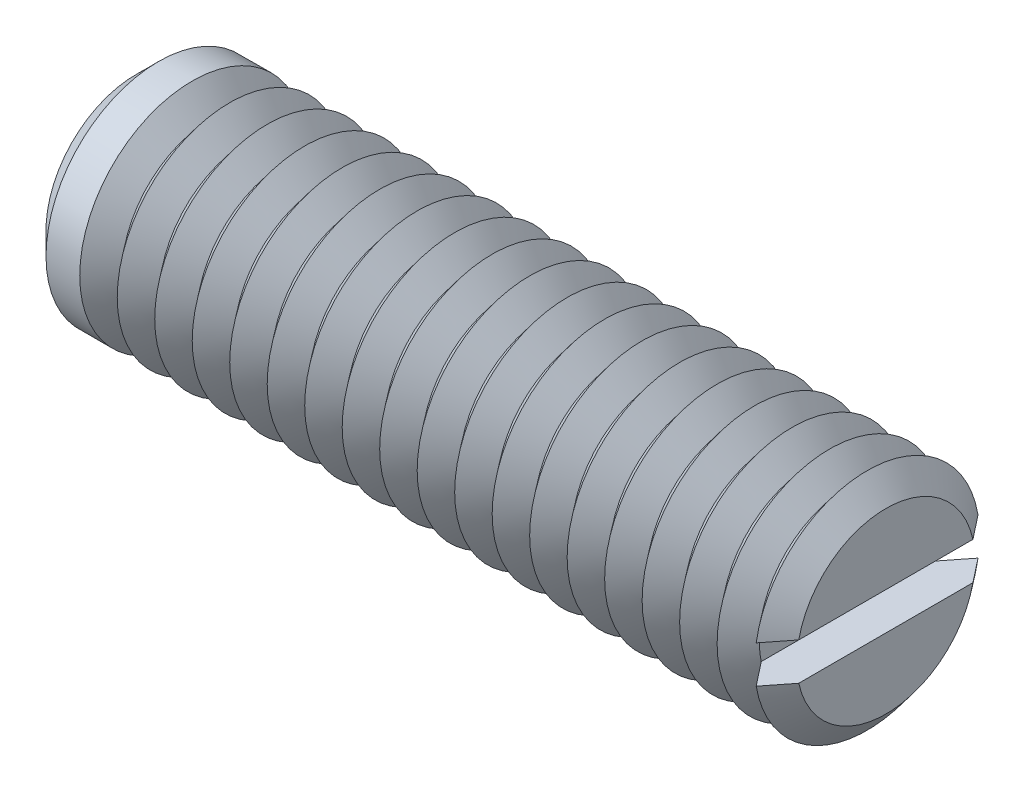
from build123d import *

# Parameters (mm, degrees)
SKETCH1_R       = 3
EXTRUDE1_DEPTH  = 10
SKETCH2_W       = 1
SKETCH2_H       = 1
EXTRUDE2_DEPTH  = 4.5
CHAMFER1_SIZE   = 0.6
LPATTERN1_COUNT = 19
LPATTERN1_PITCH = 1


with BuildPart() as part:
    # Sketch1 → Extrude1 (new, symmetric)
    with BuildSketch(Plane(origin=(0, 0, 0), x_dir=(0, 0, -1), z_dir=(1, 0, 0))):
        Circle(SKETCH1_R)
    extrude(amount=EXTRUDE1_DEPTH, both=True)

    # Sketch2 → Extrude2 (cut, symmetric)
    with BuildSketch(Plane.XY):
        with Locations((9.5, 0)):
            Rectangle(SKETCH2_W, SKETCH2_H)
    extrude(amount=EXTRUDE2_DEPTH, both=True, mode=Mode.SUBTRACT)

    # Chamfer1
    chamfer1_edges = [part.edges().sort_by_distance(p)[0] for p in [
        (-10, 0, 3),
    ]]
    chamfer(chamfer1_edges, length=CHAMFER1_SIZE)

    # Sketch3 → Cut-Revolve1 (revolve, cut)
    with BuildSketch(Plane.XY, mode=Mode.PRIVATE) as cut_revolve1_sk:
        Polygon((9.5, -3), (10.5, -3), (10, -2.3755002), align=None)
    cut_revolve1 = revolve(cut_revolve1_sk.sketch.rotate(Axis((0, 0, 0), (1, 0, 0)), 260.405931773), axis=Axis((0, 0, 0), (1, 0, 0)), mode=Mode.SUBTRACT)

    # LPattern1: Cut-Revolve1 ×19
    with Locations(*[(-i * LPATTERN1_PITCH, 0, 0) for i in range(1, LPATTERN1_COUNT)]):
        add(cut_revolve1, mode=Mode.SUBTRACT)


solid = part.part
